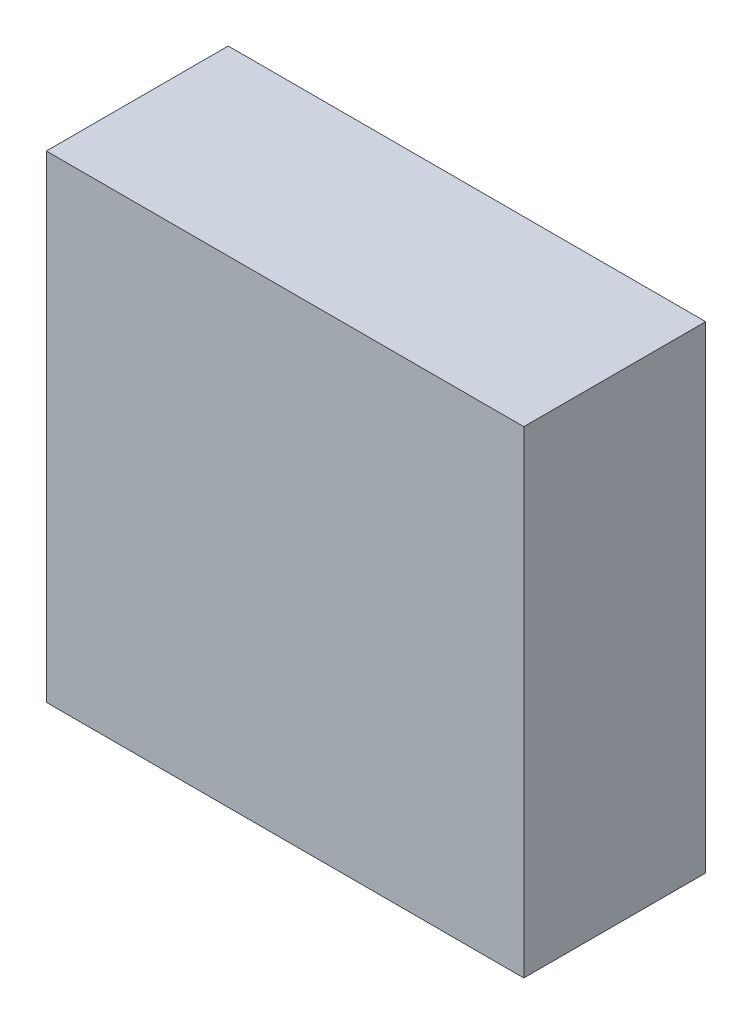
ISO-10303-21;
HEADER;
FILE_DESCRIPTION(('STEP AP214'),'2;1');
FILE_NAME('part.step','',(''),(''),'','','');
FILE_SCHEMA(('AUTOMOTIVE_DESIGN { 1 0 10303 214 1 1 1 1 }'));
ENDSEC;
DATA;
#1=APPLICATION_CONTEXT('core data for automotive mechanical design processes');
#2=APPLICATION_PROTOCOL_DEFINITION('international standard','automotive_design',2000,#1);
#3=PRODUCT_CONTEXT('',#1,'mechanical');
#4=PRODUCT('Part','Part','',(#3));
#5=PRODUCT_RELATED_PRODUCT_CATEGORY('part','',(#4));
#6=PRODUCT_DEFINITION_FORMATION('','',#4);
#7=PRODUCT_DEFINITION_CONTEXT('part definition',#1,'design');
#8=PRODUCT_DEFINITION('design','',#6,#7);
#9=PRODUCT_DEFINITION_SHAPE('','',#8);
#10=(LENGTH_UNIT() NAMED_UNIT(*) SI_UNIT(.MILLI.,.METRE.));
#11=(NAMED_UNIT(*) PLANE_ANGLE_UNIT() SI_UNIT($,.RADIAN.));
#12=(NAMED_UNIT(*) SI_UNIT($,.STERADIAN.) SOLID_ANGLE_UNIT());
#13=UNCERTAINTY_MEASURE_WITH_UNIT(LENGTH_MEASURE(1.E-05),#10,'distance_accuracy_value','');
#14=(GEOMETRIC_REPRESENTATION_CONTEXT(3) GLOBAL_UNCERTAINTY_ASSIGNED_CONTEXT((#13)) GLOBAL_UNIT_ASSIGNED_CONTEXT((#10,
#11,#12)) REPRESENTATION_CONTEXT('',''));
#15=CARTESIAN_POINT('',(0.,0.,0.));
#16=DIRECTION('',(0.,0.,1.));
#17=DIRECTION('',(1.,0.,0.));
#18=AXIS2_PLACEMENT_3D('',#15,#16,#17);
#19=CARTESIAN_POINT('',(0.,0.,0.3999992));
#20=DIRECTION('',(0.,0.,1.));
#21=DIRECTION('',(1.,0.,0.));
#22=AXIS2_PLACEMENT_3D('',#19,#20,#21);
#23=PLANE('',#22);
#24=DIRECTION('',(0.,1.,0.));
#25=VECTOR('',#24,1.);
#26=CARTESIAN_POINT('',(0.52500022,-0.52500022,0.3999992));
#27=LINE('',#26,#25);
#28=CARTESIAN_POINT('',(0.52500022,-0.52500022,0.3999992));
#29=VERTEX_POINT('',#28);
#30=CARTESIAN_POINT('',(0.52500022,0.52500022,0.3999992));
#31=VERTEX_POINT('',#30);
#32=EDGE_CURVE('E86',#29,#31,#27,.T.);
#33=ORIENTED_EDGE('',*,*,#32,.T.);
#34=DIRECTION('',(-1.,0.,0.));
#35=VECTOR('',#34,1.);
#36=CARTESIAN_POINT('',(0.52500022,0.52500022,0.3999992));
#37=LINE('',#36,#35);
#38=CARTESIAN_POINT('',(-0.52500022,0.52500022,0.3999992));
#39=VERTEX_POINT('',#38);
#40=EDGE_CURVE('E110',#31,#39,#37,.T.);
#41=ORIENTED_EDGE('',*,*,#40,.T.);
#42=DIRECTION('',(0.,-1.,0.));
#43=VECTOR('',#42,1.);
#44=CARTESIAN_POINT('',(-0.52500022,0.52500022,0.3999992));
#45=LINE('',#44,#43);
#46=CARTESIAN_POINT('',(-0.52500022,-0.52500022,0.3999992));
#47=VERTEX_POINT('',#46);
#48=EDGE_CURVE('E80',#39,#47,#45,.T.);
#49=ORIENTED_EDGE('',*,*,#48,.T.);
#50=DIRECTION('',(1.,0.,0.));
#51=VECTOR('',#50,1.);
#52=CARTESIAN_POINT('',(-0.52500022,-0.52500022,0.3999992));
#53=LINE('',#52,#51);
#54=EDGE_CURVE('E11',#47,#29,#53,.T.);
#55=ORIENTED_EDGE('',*,*,#54,.T.);
#56=EDGE_LOOP('',(#33,#41,#49,#55));
#57=FACE_BOUND('',#56,.T.);
#58=ADVANCED_FACE('F17',(#57),#23,.T.);
#59=CARTESIAN_POINT('',(0.,0.,0.));
#60=DIRECTION('',(0.,0.,1.));
#61=DIRECTION('',(1.,0.,0.));
#62=AXIS2_PLACEMENT_3D('',#59,#60,#61);
#63=PLANE('',#62);
#64=DIRECTION('',(1.,0.,0.));
#65=VECTOR('',#64,1.);
#66=CARTESIAN_POINT('',(-0.52500022,-0.52500022,0.));
#67=LINE('',#66,#65);
#68=CARTESIAN_POINT('',(-0.52500022,-0.52500022,0.));
#69=VERTEX_POINT('',#68);
#70=CARTESIAN_POINT('',(0.52500022,-0.52500022,0.));
#71=VERTEX_POINT('',#70);
#72=EDGE_CURVE('E20',#69,#71,#67,.T.);
#73=ORIENTED_EDGE('',*,*,#72,.F.);
#74=DIRECTION('',(0.,-1.,0.));
#75=VECTOR('',#74,1.);
#76=CARTESIAN_POINT('',(-0.52500022,0.52500022,0.));
#77=LINE('',#76,#75);
#78=CARTESIAN_POINT('',(-0.52500022,0.52500022,0.));
#79=VERTEX_POINT('',#78);
#80=EDGE_CURVE('E58',#79,#69,#77,.T.);
#81=ORIENTED_EDGE('',*,*,#80,.F.);
#82=DIRECTION('',(-1.,0.,0.));
#83=VECTOR('',#82,1.);
#84=CARTESIAN_POINT('',(0.52500022,0.52500022,0.));
#85=LINE('',#84,#83);
#86=CARTESIAN_POINT('',(0.52500022,0.52500022,0.));
#87=VERTEX_POINT('',#86);
#88=EDGE_CURVE('E88',#87,#79,#85,.T.);
#89=ORIENTED_EDGE('',*,*,#88,.F.);
#90=DIRECTION('',(0.,1.,0.));
#91=VECTOR('',#90,1.);
#92=CARTESIAN_POINT('',(0.52500022,-0.52500022,0.));
#93=LINE('',#92,#91);
#94=EDGE_CURVE('E85',#71,#87,#93,.T.);
#95=ORIENTED_EDGE('',*,*,#94,.F.);
#96=EDGE_LOOP('',(#73,#81,#89,#95));
#97=FACE_BOUND('',#96,.T.);
#98=ADVANCED_FACE('F90',(#97),#63,.F.);
#99=CARTESIAN_POINT('',(-0.52500022,-0.52500022,0.));
#100=DIRECTION('',(0.,1.,0.));
#101=DIRECTION('',(1.,0.,0.));
#102=AXIS2_PLACEMENT_3D('',#99,#100,#101);
#103=PLANE('',#102);
#104=ORIENTED_EDGE('',*,*,#72,.T.);
#105=DIRECTION('',(0.,0.,1.));
#106=VECTOR('',#105,1.);
#107=CARTESIAN_POINT('',(0.52500022,-0.52500022,0.));
#108=LINE('',#107,#106);
#109=EDGE_CURVE('E75',#71,#29,#108,.T.);
#110=ORIENTED_EDGE('',*,*,#109,.T.);
#111=ORIENTED_EDGE('',*,*,#54,.F.);
#112=DIRECTION('',(0.,0.,1.));
#113=VECTOR('',#112,1.);
#114=CARTESIAN_POINT('',(-0.52500022,-0.52500022,0.));
#115=LINE('',#114,#113);
#116=EDGE_CURVE('E78',#69,#47,#115,.T.);
#117=ORIENTED_EDGE('',*,*,#116,.F.);
#118=EDGE_LOOP('',(#104,#110,#111,#117));
#119=FACE_BOUND('',#118,.T.);
#120=ADVANCED_FACE('F74',(#119),#103,.F.);
#121=CARTESIAN_POINT('',(-0.52500022,0.52500022,0.));
#122=DIRECTION('',(1.,0.,0.));
#123=DIRECTION('',(0.,1.,0.));
#124=AXIS2_PLACEMENT_3D('',#121,#122,#123);
#125=PLANE('',#124);
#126=ORIENTED_EDGE('',*,*,#80,.T.);
#127=ORIENTED_EDGE('',*,*,#116,.T.);
#128=ORIENTED_EDGE('',*,*,#48,.F.);
#129=DIRECTION('',(0.,0.,1.));
#130=VECTOR('',#129,1.);
#131=CARTESIAN_POINT('',(-0.52500022,0.52500022,0.));
#132=LINE('',#131,#130);
#133=EDGE_CURVE('E105',#79,#39,#132,.T.);
#134=ORIENTED_EDGE('',*,*,#133,.F.);
#135=EDGE_LOOP('',(#126,#127,#128,#134));
#136=FACE_BOUND('',#135,.T.);
#137=ADVANCED_FACE('F122',(#136),#125,.F.);
#138=CARTESIAN_POINT('',(0.52500022,0.52500022,0.));
#139=DIRECTION('',(0.,-1.,0.));
#140=DIRECTION('',(0.,0.,-1.));
#141=AXIS2_PLACEMENT_3D('',#138,#139,#140);
#142=PLANE('',#141);
#143=ORIENTED_EDGE('',*,*,#88,.T.);
#144=ORIENTED_EDGE('',*,*,#133,.T.);
#145=ORIENTED_EDGE('',*,*,#40,.F.);
#146=DIRECTION('',(0.,0.,1.));
#147=VECTOR('',#146,1.);
#148=CARTESIAN_POINT('',(0.52500022,0.52500022,0.));
#149=LINE('',#148,#147);
#150=EDGE_CURVE('E94',#87,#31,#149,.T.);
#151=ORIENTED_EDGE('',*,*,#150,.F.);
#152=EDGE_LOOP('',(#143,#144,#145,#151));
#153=FACE_BOUND('',#152,.T.);
#154=ADVANCED_FACE('F124',(#153),#142,.F.);
#155=CARTESIAN_POINT('',(0.52500022,-0.52500022,0.));
#156=DIRECTION('',(-1.,0.,0.));
#157=DIRECTION('',(0.,0.,1.));
#158=AXIS2_PLACEMENT_3D('',#155,#156,#157);
#159=PLANE('',#158);
#160=ORIENTED_EDGE('',*,*,#94,.T.);
#161=ORIENTED_EDGE('',*,*,#150,.T.);
#162=ORIENTED_EDGE('',*,*,#32,.F.);
#163=ORIENTED_EDGE('',*,*,#109,.F.);
#164=EDGE_LOOP('',(#160,#161,#162,#163));
#165=FACE_BOUND('',#164,.T.);
#166=ADVANCED_FACE('F83',(#165),#159,.F.);
#167=CLOSED_SHELL('',(#58,#98,#120,#137,#154,#166));
#168=MANIFOLD_SOLID_BREP('B1',#167);
#169=ADVANCED_BREP_SHAPE_REPRESENTATION('',(#18,#168),#14);
#170=SHAPE_DEFINITION_REPRESENTATION(#9,#169);
ENDSEC;
END-ISO-10303-21;
